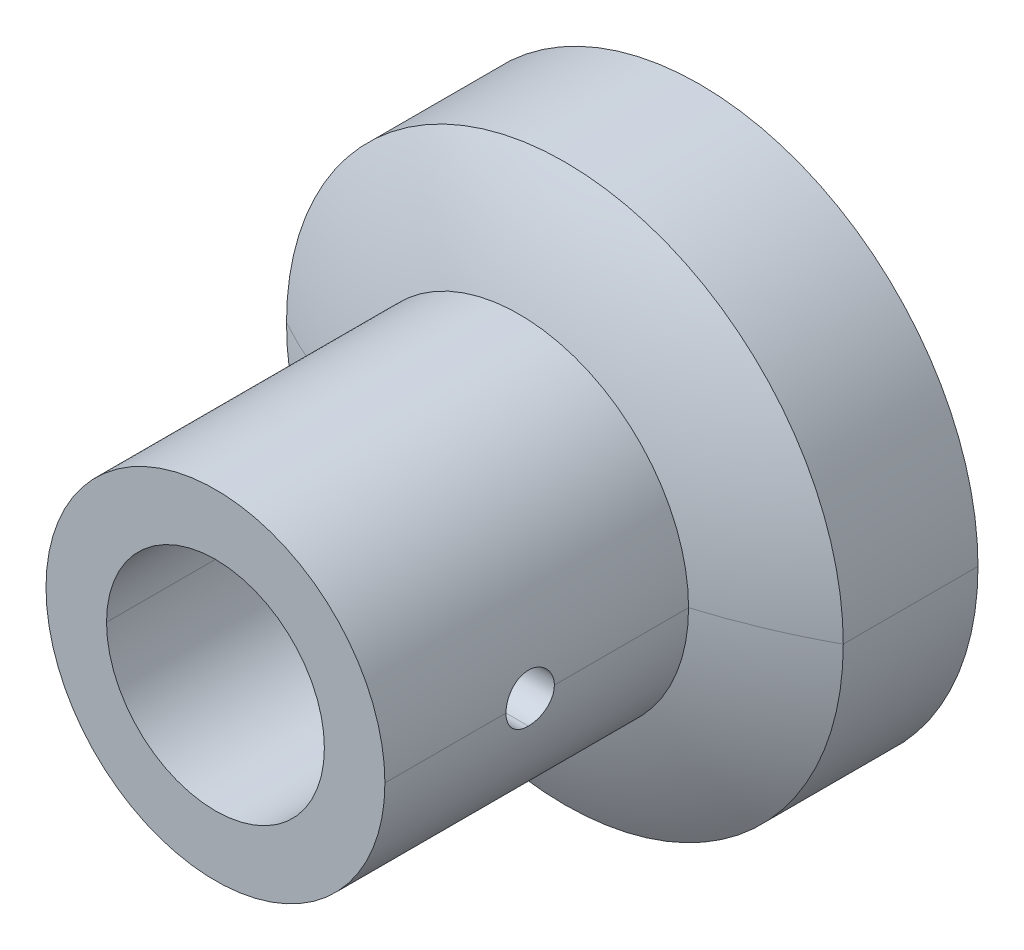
ISO-10303-21;
HEADER;
FILE_DESCRIPTION(('STEP AP214'),'2;1');
FILE_NAME('part.step','',(''),(''),'','','');
FILE_SCHEMA(('AUTOMOTIVE_DESIGN { 1 0 10303 214 1 1 1 1 }'));
ENDSEC;
DATA;
#1=APPLICATION_CONTEXT('core data for automotive mechanical design processes');
#2=APPLICATION_PROTOCOL_DEFINITION('international standard','automotive_design',2000,#1);
#3=PRODUCT_CONTEXT('',#1,'mechanical');
#4=PRODUCT('Part','Part','',(#3));
#5=PRODUCT_RELATED_PRODUCT_CATEGORY('part','',(#4));
#6=PRODUCT_DEFINITION_FORMATION('','',#4);
#7=PRODUCT_DEFINITION_CONTEXT('part definition',#1,'design');
#8=PRODUCT_DEFINITION('design','',#6,#7);
#9=PRODUCT_DEFINITION_SHAPE('','',#8);
#10=(LENGTH_UNIT() NAMED_UNIT(*) SI_UNIT(.MILLI.,.METRE.));
#11=(NAMED_UNIT(*) PLANE_ANGLE_UNIT() SI_UNIT($,.RADIAN.));
#12=(NAMED_UNIT(*) SI_UNIT($,.STERADIAN.) SOLID_ANGLE_UNIT());
#13=UNCERTAINTY_MEASURE_WITH_UNIT(LENGTH_MEASURE(1.E-05),#10,'distance_accuracy_value','');
#14=(GEOMETRIC_REPRESENTATION_CONTEXT(3) GLOBAL_UNCERTAINTY_ASSIGNED_CONTEXT((#13)) GLOBAL_UNIT_ASSIGNED_CONTEXT((#10,
#11,#12)) REPRESENTATION_CONTEXT('',''));
#15=CARTESIAN_POINT('',(0.,0.,0.));
#16=DIRECTION('',(0.,0.,1.));
#17=DIRECTION('',(1.,0.,0.));
#18=AXIS2_PLACEMENT_3D('',#15,#16,#17);
#19=CARTESIAN_POINT('',(-1.22724941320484E-11,0.,11.8371628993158));
#20=DIRECTION('',(0.,0.,1.));
#21=DIRECTION('',(1.,0.,0.));
#22=AXIS2_PLACEMENT_3D('',#19,#20,#21);
#23=CYLINDRICAL_SURFACE('',#22,22.225);
#24=CARTESIAN_POINT('',(22.2249999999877,0.,15.875));
#25=CARTESIAN_POINT('',(22.2250051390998,0.0888218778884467,15.8750090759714));
#26=CARTESIAN_POINT('',(22.2244676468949,0.177639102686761,15.8712728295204));
#27=CARTESIAN_POINT('',(22.2223454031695,0.35462934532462,15.8563799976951));
#28=CARTESIAN_POINT('',(22.2207607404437,0.442802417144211,15.8452240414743));
#29=CARTESIAN_POINT('',(22.2165845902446,0.617782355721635,15.8155794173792));
#30=CARTESIAN_POINT('',(22.2139942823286,0.704590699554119,15.7970993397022));
#31=CARTESIAN_POINT('',(22.2078839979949,0.876304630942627,15.7529632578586));
#32=CARTESIAN_POINT('',(22.2043640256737,0.961210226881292,15.7273072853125));
#33=CARTESIAN_POINT('',(22.1925452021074,1.21222884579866,15.6398058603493));
#34=CARTESIAN_POINT('',(22.1829848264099,1.3747463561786,15.5674093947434));
#35=CARTESIAN_POINT('',(22.1615641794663,1.6852329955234,15.3966742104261));
#36=CARTESIAN_POINT('',(22.1497039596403,1.83320244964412,15.2983360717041));
#37=CARTESIAN_POINT('',(22.1249103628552,2.11154436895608,15.0777541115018));
#38=CARTESIAN_POINT('',(22.1119707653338,2.24180156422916,14.9553652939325));
#39=CARTESIAN_POINT('',(22.0865240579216,2.48001539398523,14.6904496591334));
#40=CARTESIAN_POINT('',(22.0740170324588,2.58796769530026,14.5479189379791));
#41=CARTESIAN_POINT('',(22.0507893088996,2.77896493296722,14.2459777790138));
#42=CARTESIAN_POINT('',(22.0400772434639,2.86189095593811,14.0864914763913));
#43=CARTESIAN_POINT('',(22.0217469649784,2.99969137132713,13.7557109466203));
#44=CARTESIAN_POINT('',(22.0141267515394,3.05458390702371,13.5844244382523));
#45=CARTESIAN_POINT('',(22.0047409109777,3.12133469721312,13.2934388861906));
#46=CARTESIAN_POINT('',(22.0018701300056,3.14144116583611,13.1756014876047));
#47=CARTESIAN_POINT('',(21.9980160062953,3.16827517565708,12.9385271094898));
#48=CARTESIAN_POINT('',(21.9970303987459,3.17501877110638,12.81929198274));
#49=CARTESIAN_POINT('',(21.9970452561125,3.175,12.7));
#50=B_SPLINE_CURVE_WITH_KNOTS('',3,(#24,#25,#26,#27,#28,#29,#30,#31,#32,#33,#34,#35,#36,#37,#38,
#39,#40,#41,#42,#43,#44,#45,#46,#47,#48,#49),.UNSPECIFIED.,.F.,.F.,(4,2,2,2,2,2,2,2,2,2,2,2,4),
(0.,0.266377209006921,0.532731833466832,0.798774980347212,1.0648169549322,1.59659232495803,
2.12835580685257,2.66342937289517,3.1986067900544,3.73628847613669,4.27362173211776,
4.63162414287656,4.98919618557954),.UNSPECIFIED.);
#51=CARTESIAN_POINT('',(22.2249999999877,0.,15.875));
#52=VERTEX_POINT('',#51);
#53=CARTESIAN_POINT('',(21.9970452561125,3.175,12.7));
#54=VERTEX_POINT('',#53);
#55=EDGE_CURVE('E197',#52,#54,#50,.T.);
#56=ORIENTED_EDGE('',*,*,#55,.T.);
#57=CARTESIAN_POINT('',(21.9970452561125,3.175,12.7));
#58=CARTESIAN_POINT('',(21.9970399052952,3.17500908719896,12.6111828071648));
#59=CARTESIAN_POINT('',(21.9975830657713,3.17127322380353,12.5223702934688));
#60=CARTESIAN_POINT('',(21.9997268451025,3.156381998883,12.345389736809));
#61=CARTESIAN_POINT('',(22.0013273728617,3.14522727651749,12.257221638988));
#62=CARTESIAN_POINT('',(22.0055438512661,3.11558617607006,12.0822525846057));
#63=CARTESIAN_POINT('',(22.0081586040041,3.09710844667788,11.9954501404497));
#64=CARTESIAN_POINT('',(22.0143235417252,3.052978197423,11.823748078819));
#65=CARTESIAN_POINT('',(22.0178737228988,3.02732570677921,11.7388484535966));
#66=CARTESIAN_POINT('',(22.0297867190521,2.93983692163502,11.4878486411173));
#67=CARTESIAN_POINT('',(22.0394146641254,2.86745161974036,11.3253437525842));
#68=CARTESIAN_POINT('',(22.0609509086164,2.69674251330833,11.0148778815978));
#69=CARTESIAN_POINT('',(22.0728591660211,2.59841918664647,10.8669166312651));
#70=CARTESIAN_POINT('',(22.097710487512,2.37785216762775,10.5885650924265));
#71=CARTESIAN_POINT('',(22.1106596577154,2.25546015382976,10.4582926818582));
#72=CARTESIAN_POINT('',(22.1360809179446,1.99053188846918,10.2200496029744));
#73=CARTESIAN_POINT('',(22.148552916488,1.84799179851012,10.1120831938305));
#74=CARTESIAN_POINT('',(22.1716798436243,1.54604243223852,9.92107114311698));
#75=CARTESIAN_POINT('',(22.1823261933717,1.38655892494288,9.83814183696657));
#76=CARTESIAN_POINT('',(22.2005247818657,1.05578411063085,9.70033442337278));
#77=CARTESIAN_POINT('',(22.2080790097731,0.884500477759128,9.64543827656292));
#78=CARTESIAN_POINT('',(22.217379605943,0.593504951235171,9.57867729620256));
#79=CARTESIAN_POINT('',(22.2202228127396,0.475653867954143,9.55856622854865));
#80=CARTESIAN_POINT('',(22.2240390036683,0.238552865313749,9.53172627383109));
#81=CARTESIAN_POINT('',(22.2250142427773,0.119304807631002,9.52498125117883));
#82=CARTESIAN_POINT('',(22.2249999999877,0.,9.525));
#83=B_SPLINE_CURVE_WITH_KNOTS('',3,(#57,#58,#59,#60,#61,#62,#63,#64,#65,#66,#67,#68,#69,#70,#71,
#72,#73,#74,#75,#76,#77,#78,#79,#80,#81,#82),.UNSPECIFIED.,.F.,.F.,(4,2,2,2,2,2,2,2,2,2,2,2,4),
(0.,0.266363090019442,0.532703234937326,0.798729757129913,1.06475519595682,1.59649416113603,
2.12822333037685,2.66333816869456,3.19855508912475,3.73622193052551,4.27354234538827,
4.63158555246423,4.98919626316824),.UNSPECIFIED.);
#84=CARTESIAN_POINT('',(22.2249999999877,0.,9.525));
#85=VERTEX_POINT('',#84);
#86=EDGE_CURVE('E170',#54,#85,#83,.T.);
#87=ORIENTED_EDGE('',*,*,#86,.T.);
#88=DIRECTION('',(0.,0.,1.));
#89=VECTOR('',#88,1.);
#90=CARTESIAN_POINT('',(22.2249999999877,0.,11.8371628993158));
#91=LINE('',#90,#89);
#92=CARTESIAN_POINT('',(22.2249999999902,0.,-8.07567420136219));
#93=VERTEX_POINT('',#92);
#94=EDGE_CURVE('E273',#93,#85,#91,.T.);
#95=ORIENTED_EDGE('',*,*,#94,.F.);
#96=CARTESIAN_POINT('',(-1.22724941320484E-11,0.,-8.07567420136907));
#97=DIRECTION('',(0.,0.,1.));
#98=DIRECTION('',(1.,0.,0.));
#99=AXIS2_PLACEMENT_3D('',#96,#97,#98);
#100=CIRCLE('',#99,22.225);
#101=CARTESIAN_POINT('',(-22.2250000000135,0.,-8.07567420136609));
#102=VERTEX_POINT('',#101);
#103=EDGE_CURVE('E101',#102,#93,#100,.F.);
#104=ORIENTED_EDGE('',*,*,#103,.F.);
#105=DIRECTION('',(0.,0.,1.));
#106=VECTOR('',#105,1.);
#107=CARTESIAN_POINT('',(-22.2250000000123,0.,11.8371628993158));
#108=LINE('',#107,#106);
#109=CARTESIAN_POINT('',(-22.2250000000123,0.,31.75));
#110=VERTEX_POINT('',#109);
#111=EDGE_CURVE('E268',#110,#102,#108,.F.);
#112=ORIENTED_EDGE('',*,*,#111,.F.);
#113=CARTESIAN_POINT('',(-1.22724941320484E-11,0.,31.75));
#114=DIRECTION('',(0.,0.,1.));
#115=DIRECTION('',(1.,0.,0.));
#116=AXIS2_PLACEMENT_3D('',#113,#114,#115);
#117=CIRCLE('',#116,22.225);
#118=CARTESIAN_POINT('',(22.2249999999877,0.,31.75));
#119=VERTEX_POINT('',#118);
#120=EDGE_CURVE('E94',#119,#110,#117,.T.);
#121=ORIENTED_EDGE('',*,*,#120,.F.);
#122=DIRECTION('',(0.,0.,1.));
#123=VECTOR('',#122,1.);
#124=CARTESIAN_POINT('',(22.2249999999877,0.,11.8371628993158));
#125=LINE('',#124,#123);
#126=EDGE_CURVE('E270',#52,#119,#125,.T.);
#127=ORIENTED_EDGE('',*,*,#126,.F.);
#128=EDGE_LOOP('',(#56,#87,#95,#104,#112,#121,#127));
#129=FACE_BOUND('',#128,.T.);
#130=ADVANCED_FACE('F16',(#129),#23,.T.);
#131=CARTESIAN_POINT('',(-1.22724941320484E-11,0.,11.8371628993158));
#132=DIRECTION('',(0.,0.,1.));
#133=DIRECTION('',(1.,0.,0.));
#134=AXIS2_PLACEMENT_3D('',#131,#132,#133);
#135=CYLINDRICAL_SURFACE('',#134,22.225);
#136=ORIENTED_EDGE('',*,*,#111,.T.);
#137=CARTESIAN_POINT('',(-1.22724941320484E-11,0.,-8.07567420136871));
#138=DIRECTION('',(0.,0.,1.));
#139=DIRECTION('',(1.,0.,0.));
#140=AXIS2_PLACEMENT_3D('',#137,#138,#139);
#141=CIRCLE('',#140,22.225);
#142=EDGE_CURVE('E132',#93,#102,#141,.F.);
#143=ORIENTED_EDGE('',*,*,#142,.F.);
#144=ORIENTED_EDGE('',*,*,#94,.T.);
#145=CARTESIAN_POINT('',(22.2249999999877,0.,9.525));
#146=CARTESIAN_POINT('',(22.2250051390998,-0.0888218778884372,9.52499092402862));
#147=CARTESIAN_POINT('',(22.2244676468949,-0.177639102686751,9.52872717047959));
#148=CARTESIAN_POINT('',(22.2223454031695,-0.354629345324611,9.54362000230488));
#149=CARTESIAN_POINT('',(22.2207607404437,-0.442802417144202,9.55477595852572));
#150=CARTESIAN_POINT('',(22.2165845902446,-0.617782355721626,9.58442058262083));
#151=CARTESIAN_POINT('',(22.2139942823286,-0.70459069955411,9.60290066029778));
#152=CARTESIAN_POINT('',(22.2078839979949,-0.876304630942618,9.64703674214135));
#153=CARTESIAN_POINT('',(22.2043640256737,-0.961210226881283,9.67269271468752));
#154=CARTESIAN_POINT('',(22.1925452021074,-1.21222884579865,9.76019413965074));
#155=CARTESIAN_POINT('',(22.1829848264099,-1.37474635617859,9.8325906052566));
#156=CARTESIAN_POINT('',(22.1615641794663,-1.68523299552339,10.0033257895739));
#157=CARTESIAN_POINT('',(22.1497039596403,-1.83320244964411,10.1016639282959));
#158=CARTESIAN_POINT('',(22.1249103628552,-2.11154436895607,10.3222458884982));
#159=CARTESIAN_POINT('',(22.1119707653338,-2.24180156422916,10.4446347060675));
#160=CARTESIAN_POINT('',(22.0865240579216,-2.48001539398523,10.7095503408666));
#161=CARTESIAN_POINT('',(22.0740170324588,-2.58796769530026,10.8520810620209));
#162=CARTESIAN_POINT('',(22.0507893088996,-2.77896493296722,11.1540222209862));
#163=CARTESIAN_POINT('',(22.0400772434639,-2.8618909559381,11.3135085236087));
#164=CARTESIAN_POINT('',(22.0217469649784,-2.99969137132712,11.6442890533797));
#165=CARTESIAN_POINT('',(22.0141267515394,-3.05458390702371,11.8155755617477));
#166=CARTESIAN_POINT('',(22.0047409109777,-3.12133469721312,12.1065611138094));
#167=CARTESIAN_POINT('',(22.0018701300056,-3.14144116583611,12.2243985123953));
#168=CARTESIAN_POINT('',(21.9980160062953,-3.16827517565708,12.4614728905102));
#169=CARTESIAN_POINT('',(21.9970303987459,-3.17501877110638,12.58070801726));
#170=CARTESIAN_POINT('',(21.9970452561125,-3.175,12.7));
#171=B_SPLINE_CURVE_WITH_KNOTS('',3,(#145,#146,#147,#148,#149,#150,#151,#152,#153,#154,#155,
#156,#157,#158,#159,#160,#161,#162,#163,#164,#165,#166,#167,#168,#169,#170),.UNSPECIFIED.,.F.,
.F.,(4,2,2,2,2,2,2,2,2,2,2,2,4),(0.,0.266377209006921,0.532731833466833,0.798774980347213,
1.0648169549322,1.59659232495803,2.12835580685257,2.66342937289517,3.1986067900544,
3.73628847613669,4.27362173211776,4.63162414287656,4.98919618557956),.UNSPECIFIED.);
#172=CARTESIAN_POINT('',(21.9970452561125,-3.175,12.7));
#173=VERTEX_POINT('',#172);
#174=EDGE_CURVE('E165',#85,#173,#171,.T.);
#175=ORIENTED_EDGE('',*,*,#174,.T.);
#176=CARTESIAN_POINT('',(21.9970452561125,-3.175,12.7));
#177=CARTESIAN_POINT('',(21.9970399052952,-3.17500908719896,12.7888171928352));
#178=CARTESIAN_POINT('',(21.9975830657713,-3.17127322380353,12.8776297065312));
#179=CARTESIAN_POINT('',(21.9997268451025,-3.156381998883,13.054610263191));
#180=CARTESIAN_POINT('',(22.0013273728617,-3.14522727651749,13.142778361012));
#181=CARTESIAN_POINT('',(22.0055438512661,-3.11558617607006,13.3177474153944));
#182=CARTESIAN_POINT('',(22.0081586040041,-3.09710844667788,13.4045498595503));
#183=CARTESIAN_POINT('',(22.0143235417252,-3.052978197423,13.576251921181));
#184=CARTESIAN_POINT('',(22.0178737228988,-3.02732570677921,13.6611515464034));
#185=CARTESIAN_POINT('',(22.0297867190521,-2.93983692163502,13.9121513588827));
#186=CARTESIAN_POINT('',(22.0394146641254,-2.86745161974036,14.0746562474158));
#187=CARTESIAN_POINT('',(22.0609509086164,-2.69674251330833,14.3851221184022));
#188=CARTESIAN_POINT('',(22.0728591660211,-2.59841918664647,14.5330833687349));
#189=CARTESIAN_POINT('',(22.097710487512,-2.37785216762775,14.8114349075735));
#190=CARTESIAN_POINT('',(22.1106596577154,-2.25546015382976,14.9417073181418));
#191=CARTESIAN_POINT('',(22.1360809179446,-1.99053188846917,15.1799503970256));
#192=CARTESIAN_POINT('',(22.148552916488,-1.84799179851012,15.2879168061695));
#193=CARTESIAN_POINT('',(22.1716798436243,-1.54604243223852,15.478928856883));
#194=CARTESIAN_POINT('',(22.1823261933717,-1.38655892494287,15.5618581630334));
#195=CARTESIAN_POINT('',(22.2005247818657,-1.05578411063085,15.6996655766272));
#196=CARTESIAN_POINT('',(22.2080790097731,-0.884500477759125,15.7545617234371));
#197=CARTESIAN_POINT('',(22.217379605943,-0.593504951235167,15.8213227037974));
#198=CARTESIAN_POINT('',(22.2202228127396,-0.475653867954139,15.8414337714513));
#199=CARTESIAN_POINT('',(22.2240390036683,-0.238552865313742,15.8682737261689));
#200=CARTESIAN_POINT('',(22.2250142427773,-0.119304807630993,15.8750187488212));
#201=CARTESIAN_POINT('',(22.2249999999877,0.,15.875));
#202=B_SPLINE_CURVE_WITH_KNOTS('',3,(#176,#177,#178,#179,#180,#181,#182,#183,#184,#185,#186,
#187,#188,#189,#190,#191,#192,#193,#194,#195,#196,#197,#198,#199,#200,#201),.UNSPECIFIED.,.F.,
.F.,(4,2,2,2,2,2,2,2,2,2,2,2,4),(0.,0.266363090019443,0.532703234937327,0.798729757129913,
1.06475519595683,1.59649416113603,2.12822333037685,2.66333816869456,3.19855508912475,
3.73622193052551,4.27354234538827,4.63158555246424,4.98919626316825),.UNSPECIFIED.);
#203=EDGE_CURVE('E189',#173,#52,#202,.T.);
#204=ORIENTED_EDGE('',*,*,#203,.T.);
#205=ORIENTED_EDGE('',*,*,#126,.T.);
#206=CARTESIAN_POINT('',(-1.22724941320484E-11,0.,31.75));
#207=DIRECTION('',(0.,0.,1.));
#208=DIRECTION('',(1.,0.,0.));
#209=AXIS2_PLACEMENT_3D('',#206,#207,#208);
#210=CIRCLE('',#209,22.225);
#211=EDGE_CURVE('E355',#110,#119,#210,.T.);
#212=ORIENTED_EDGE('',*,*,#211,.F.);
#213=EDGE_LOOP('',(#136,#143,#144,#175,#204,#205,#212));
#214=FACE_BOUND('',#213,.T.);
#215=ADVANCED_FACE('F179',(#214),#135,.T.);
#216=CARTESIAN_POINT('',(0.,0.,-80.9624999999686));
#217=DIRECTION('',(0.204457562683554,0.963484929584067,0.172898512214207));
#218=DIRECTION('',(-0.859691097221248,0.0922736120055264,0.502410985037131));
#219=AXIS2_PLACEMENT_3D('',#216,#217,#218);
#220=SPHERICAL_SURFACE('',#219,76.1999999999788);
#221=CARTESIAN_POINT('',(-22.2250000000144,0.,-8.07567420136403));
#222=CARTESIAN_POINT('',(-22.7846731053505,-3.55013624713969E-06,-8.24633102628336));
#223=CARTESIAN_POINT('',(-23.3423801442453,-4.0679638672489E-05,-8.42343670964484));
#224=CARTESIAN_POINT('',(-24.4703018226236,-0.000145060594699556,-8.79597338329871));
#225=CARTESIAN_POINT('',(-25.0403872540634,-0.000213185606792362,-8.99179565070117));
#226=CARTESIAN_POINT('',(-26.1923629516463,-0.000339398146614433,-9.40283955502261));
#227=CARTESIAN_POINT('',(-26.7741105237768,-0.000397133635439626,-9.61846117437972));
#228=CARTESIAN_POINT('',(-27.9486382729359,-0.00048011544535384,-10.0701824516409));
#229=CARTESIAN_POINT('',(-28.5412615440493,-0.000504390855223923,-10.306690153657));
#230=CARTESIAN_POINT('',(-29.7366948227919,-0.000510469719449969,-10.8012650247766));
#231=CARTESIAN_POINT('',(-30.3393329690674,-0.000491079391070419,-11.0597476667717));
#232=CARTESIAN_POINT('',(-31.5538736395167,-0.000415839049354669,-11.5993509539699));
#233=CARTESIAN_POINT('',(-32.1655886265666,-0.000359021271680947,-11.8808937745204));
#234=CARTESIAN_POINT('',(-33.397280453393,-0.000230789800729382,-12.4676892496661));
#235=CARTESIAN_POINT('',(-34.017053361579,-0.000159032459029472,-12.7733700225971));
#236=CARTESIAN_POINT('',(-35.2637777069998,-4.44316623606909E-05,-13.4094966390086));
#237=CARTESIAN_POINT('',(-35.8905081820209,-2.37351360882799E-06,-13.7403756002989));
#238=CARTESIAN_POINT('',(-36.5125000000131,0.,-14.0799361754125));
#239=B_SPLINE_CURVE_WITH_KNOTS('',3,(#221,#222,#223,#224,#225,#226,#227,#228,#229,#230,#231,
#232,#233,#234,#235,#236,#237,#238),.UNSPECIFIED.,.F.,.F.,(4,2,2,2,2,2,2,2,4),(0.,
1.75530258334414,3.56347297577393,5.42455263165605,7.33857288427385,9.30555397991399,
11.3255040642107,13.3984181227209,15.5242768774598),.UNSPECIFIED.);
#240=CARTESIAN_POINT('',(-36.5125000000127,0.,-14.0799361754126));
#241=VERTEX_POINT('',#240);
#242=EDGE_CURVE('E113',#102,#241,#239,.T.);
#243=ORIENTED_EDGE('',*,*,#242,.F.);
#244=ORIENTED_EDGE('',*,*,#103,.T.);
#245=CARTESIAN_POINT('',(36.5124999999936,0.,-14.0799361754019));
#246=CARTESIAN_POINT('',(35.9537311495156,-7.32572720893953E-07,-13.7748912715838));
#247=CARTESIAN_POINT('',(35.3911378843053,-8.35959394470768E-06,-13.476851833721));
#248=CARTESIAN_POINT('',(34.2561431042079,-2.94500270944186E-05,-12.8936710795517));
#249=CARTESIAN_POINT('',(33.6837091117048,-4.29392258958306E-05,-12.6085929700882));
#250=CARTESIAN_POINT('',(32.5292518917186,-6.77080975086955E-05,-12.0516854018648));
#251=CARTESIAN_POINT('',(31.9471970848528,-7.897754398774E-05,-11.7799214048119));
#252=CARTESIAN_POINT('',(30.7737311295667,-9.48200927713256E-05,-11.2499916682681));
#253=CARTESIAN_POINT('',(30.1822894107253,-9.93624111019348E-05,-10.9918936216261));
#254=CARTESIAN_POINT('',(28.9902952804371,-9.99589619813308E-05,-10.4896471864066));
#255=CARTESIAN_POINT('',(28.3897134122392,-9.59739075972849E-05,-10.2455687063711));
#256=CARTESIAN_POINT('',(27.1796983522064,-8.089990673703E-05,-9.77171309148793));
#257=CARTESIAN_POINT('',(26.5702369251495,-6.97778772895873E-05,-9.54200805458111));
#258=CARTESIAN_POINT('',(25.3427358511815,-4.4770170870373E-05,-9.09725201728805));
#259=CARTESIAN_POINT('',(24.7246692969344,-3.08717010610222E-05,-8.88227527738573));
#260=CARTESIAN_POINT('',(23.4802464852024,-8.86461372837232E-06,-8.46732534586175));
#261=CARTESIAN_POINT('',(22.8538647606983,-7.83900229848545E-07,-8.26742852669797));
#262=CARTESIAN_POINT('',(22.2249999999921,0.,-8.07567420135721));
#263=B_SPLINE_CURVE_WITH_KNOTS('',3,(#245,#246,#247,#248,#249,#250,#251,#252,#253,#254,#255,
#256,#257,#258,#259,#260,#261,#262),.UNSPECIFIED.,.F.,.F.,(4,2,2,2,2,2,2,2,4),(0.,
1.9097865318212,3.82806034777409,5.75497487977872,7.69068019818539,9.63532280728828,
11.5890454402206,13.5519868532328,15.5242816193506),.UNSPECIFIED.);
#264=CARTESIAN_POINT('',(36.5124999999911,0.,-14.0799361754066));
#265=VERTEX_POINT('',#264);
#266=EDGE_CURVE('E117',#265,#93,#263,.T.);
#267=ORIENTED_EDGE('',*,*,#266,.F.);
#268=CARTESIAN_POINT('',(-1.22724941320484E-11,0.,-14.0799361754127));
#269=DIRECTION('',(0.,0.,1.));
#270=DIRECTION('',(1.,0.,0.));
#271=AXIS2_PLACEMENT_3D('',#268,#269,#270);
#272=CIRCLE('',#271,36.5125);
#273=EDGE_CURVE('E110',#241,#265,#272,.F.);
#274=ORIENTED_EDGE('',*,*,#273,.F.);
#275=EDGE_LOOP('',(#243,#244,#267,#274));
#276=FACE_BOUND('',#275,.T.);
#277=ADVANCED_FACE('F112',(#276),#220,.T.);
#278=CARTESIAN_POINT('',(0.,0.,-80.9624999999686));
#279=DIRECTION('',(0.204457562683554,0.963484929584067,0.172898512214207));
#280=DIRECTION('',(-0.859691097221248,0.0922736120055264,0.502410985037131));
#281=AXIS2_PLACEMENT_3D('',#278,#279,#280);
#282=SPHERICAL_SURFACE('',#281,76.1999999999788);
#283=ORIENTED_EDGE('',*,*,#242,.T.);
#284=CARTESIAN_POINT('',(-1.22724941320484E-11,0.,-14.0799361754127));
#285=DIRECTION('',(0.,0.,1.));
#286=DIRECTION('',(1.,0.,0.));
#287=AXIS2_PLACEMENT_3D('',#284,#285,#286);
#288=CIRCLE('',#287,36.5125);
#289=EDGE_CURVE('E129',#265,#241,#288,.F.);
#290=ORIENTED_EDGE('',*,*,#289,.F.);
#291=ORIENTED_EDGE('',*,*,#266,.T.);
#292=ORIENTED_EDGE('',*,*,#142,.T.);
#293=EDGE_LOOP('',(#283,#290,#291,#292));
#294=FACE_BOUND('',#293,.T.);
#295=ADVANCED_FACE('F127',(#294),#282,.T.);
#296=CARTESIAN_POINT('',(13.969999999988,0.,12.7));
#297=DIRECTION('',(-1.,0.,0.));
#298=DIRECTION('',(0.,0.,1.));
#299=AXIS2_PLACEMENT_3D('',#296,#297,#298);
#300=PLANE('',#299);
#301=CARTESIAN_POINT('',(13.969999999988,0.,12.7));
#302=DIRECTION('',(1.,0.,0.));
#303=DIRECTION('',(0.,0.,-1.));
#304=AXIS2_PLACEMENT_3D('',#301,#302,#303);
#305=CIRCLE('',#304,3.175);
#306=CARTESIAN_POINT('',(13.969999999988,2.99528900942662,11.6469716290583));
#307=VERTEX_POINT('',#306);
#308=CARTESIAN_POINT('',(13.969999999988,3.175,12.7));
#309=VERTEX_POINT('',#308);
#310=EDGE_CURVE('E160',#307,#309,#305,.T.);
#311=ORIENTED_EDGE('',*,*,#310,.T.);
#312=CARTESIAN_POINT('',(13.969999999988,0.,12.7));
#313=DIRECTION('',(1.,0.,0.));
#314=DIRECTION('',(0.,0.,-1.));
#315=AXIS2_PLACEMENT_3D('',#312,#313,#314);
#316=CIRCLE('',#315,3.175);
#317=CARTESIAN_POINT('',(13.969999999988,2.99528900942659,13.7530283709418));
#318=VERTEX_POINT('',#317);
#319=EDGE_CURVE('E198',#309,#318,#316,.T.);
#320=ORIENTED_EDGE('',*,*,#319,.T.);
#321=DIRECTION('',(0.,0.,1.));
#322=VECTOR('',#321,1.);
#323=CARTESIAN_POINT('',(13.969999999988,2.99528900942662,0.));
#324=LINE('',#323,#322);
#325=EDGE_CURVE('E315',#307,#318,#324,.T.);
#326=ORIENTED_EDGE('',*,*,#325,.F.);
#327=EDGE_LOOP('',(#311,#320,#326));
#328=FACE_BOUND('',#327,.T.);
#329=ADVANCED_FACE('F302',(#328),#300,.F.);
#330=CARTESIAN_POINT('',(18.256249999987,0.,31.75));
#331=DIRECTION('',(0.,0.,1.));
#332=DIRECTION('',(1.,0.,0.));
#333=AXIS2_PLACEMENT_3D('',#330,#331,#332);
#334=PLANE('',#333);
#335=ORIENTED_EDGE('',*,*,#120,.T.);
#336=ORIENTED_EDGE('',*,*,#211,.T.);
#337=EDGE_LOOP('',(#335,#336));
#338=FACE_BOUND('',#337,.T.);
#339=CARTESIAN_POINT('',(-1.22731685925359E-11,0.,31.75));
#340=DIRECTION('',(0.,0.,1.));
#341=DIRECTION('',(1.,0.,0.));
#342=AXIS2_PLACEMENT_3D('',#339,#340,#341);
#343=CIRCLE('',#342,14.2875);
#344=CARTESIAN_POINT('',(14.2874999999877,0.,31.75));
#345=VERTEX_POINT('',#344);
#346=CARTESIAN_POINT('',(-14.2875000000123,0.,31.75));
#347=VERTEX_POINT('',#346);
#348=EDGE_CURVE('E332',#345,#347,#343,.T.);
#349=ORIENTED_EDGE('',*,*,#348,.F.);
#350=CARTESIAN_POINT('',(-1.22731685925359E-11,0.,31.75));
#351=DIRECTION('',(0.,0.,1.));
#352=DIRECTION('',(1.,0.,0.));
#353=AXIS2_PLACEMENT_3D('',#350,#351,#352);
#354=CIRCLE('',#353,14.2875);
#355=EDGE_CURVE('E235',#347,#345,#354,.T.);
#356=ORIENTED_EDGE('',*,*,#355,.F.);
#357=EDGE_LOOP('',(#349,#356));
#358=FACE_BOUND('',#357,.T.);
#359=ADVANCED_FACE('F208',(#338,#358),#334,.T.);
#360=CARTESIAN_POINT('',(18.732499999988,0.,12.7));
#361=DIRECTION('',(1.,0.,0.));
#362=DIRECTION('',(0.,0.,-1.));
#363=AXIS2_PLACEMENT_3D('',#360,#361,#362);
#364=CYLINDRICAL_SURFACE('',#363,3.175);
#365=ORIENTED_EDGE('',*,*,#55,.F.);
#366=ORIENTED_EDGE('',*,*,#203,.F.);
#367=DIRECTION('',(1.,0.,0.));
#368=VECTOR('',#367,1.);
#369=CARTESIAN_POINT('',(18.732499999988,-3.175,12.7));
#370=LINE('',#369,#368);
#371=CARTESIAN_POINT('',(13.969999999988,-3.175,12.7));
#372=VERTEX_POINT('',#371);
#373=EDGE_CURVE('E164',#173,#372,#370,.F.);
#374=ORIENTED_EDGE('',*,*,#373,.T.);
#375=CARTESIAN_POINT('',(13.969999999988,0.,12.7));
#376=DIRECTION('',(1.,0.,0.));
#377=DIRECTION('',(0.,0.,-1.));
#378=AXIS2_PLACEMENT_3D('',#375,#376,#377);
#379=CIRCLE('',#378,3.175);
#380=CARTESIAN_POINT('',(13.969999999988,-2.99528900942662,13.7530283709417));
#381=VERTEX_POINT('',#380);
#382=EDGE_CURVE('E344',#372,#381,#379,.F.);
#383=ORIENTED_EDGE('',*,*,#382,.T.);
#384=CARTESIAN_POINT('',(14.2874999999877,0.,15.875));
#385=CARTESIAN_POINT('',(14.2875077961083,-0.0881471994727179,15.8750097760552));
#386=CARTESIAN_POINT('',(14.2866844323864,-0.176288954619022,15.8713292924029));
#387=CARTESIAN_POINT('',(14.283433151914,-0.351921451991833,15.8566635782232));
#388=CARTESIAN_POINT('',(14.281005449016,-0.439412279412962,15.8456793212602));
#389=CARTESIAN_POINT('',(14.2746084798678,-0.612984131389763,15.8165057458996));
#390=CARTESIAN_POINT('',(14.2706417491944,-0.699067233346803,15.7983282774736));
#391=CARTESIAN_POINT('',(14.2612830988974,-0.869336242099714,15.7549318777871));
#392=CARTESIAN_POINT('',(14.2558911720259,-0.953522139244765,15.7297129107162));
#393=CARTESIAN_POINT('',(14.2377856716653,-1.20235132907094,15.6437560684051));
#394=CARTESIAN_POINT('',(14.2231362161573,-1.36342276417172,15.572691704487));
#395=CARTESIAN_POINT('',(14.1902590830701,-1.67130831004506,15.4052028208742));
#396=CARTESIAN_POINT('',(14.1720305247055,-1.81811889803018,15.3087720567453));
#397=CARTESIAN_POINT('',(14.1336522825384,-2.09582417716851,15.0915835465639));
#398=CARTESIAN_POINT('',(14.1134779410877,-2.22644795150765,14.9704834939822));
#399=CARTESIAN_POINT('',(14.0736609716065,-2.46565444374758,14.7081465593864));
#400=CARTESIAN_POINT('',(14.05401810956,-2.57424700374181,14.56691871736));
#401=CARTESIAN_POINT('',(14.023032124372,-2.73713072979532,14.313695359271));
#402=CARTESIAN_POINT('',(14.010982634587,-2.79788919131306,14.2058872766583));
#403=CARTESIAN_POINT('',(13.9888584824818,-2.90645324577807,13.9839115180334));
#404=CARTESIAN_POINT('',(13.9787814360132,-2.95427450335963,13.8697517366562));
#405=CARTESIAN_POINT('',(13.969999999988,-2.99528900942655,13.7530283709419));
#406=B_SPLINE_CURVE_WITH_KNOTS('',3,(#384,#385,#386,#387,#388,#389,#390,#391,#392,#393,#394,
#395,#396,#397,#398,#399,#400,#401,#402,#403,#404,#405),.UNSPECIFIED.,.F.,.F.,(4,2,2,2,2,2,2,2,
2,2,4),(0.,0.264351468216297,0.528667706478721,0.792550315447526,1.05643426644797,
1.5837311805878,2.11115802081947,2.64647409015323,3.18155048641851,3.55375272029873,
3.92550224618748),.UNSPECIFIED.);
#407=CARTESIAN_POINT('',(14.2874999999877,0.,15.875));
#408=VERTEX_POINT('',#407);
#409=EDGE_CURVE('E220',#408,#381,#406,.T.);
#410=ORIENTED_EDGE('',*,*,#409,.F.);
#411=CARTESIAN_POINT('',(13.969999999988,2.99528900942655,13.7530283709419));
#412=CARTESIAN_POINT('',(13.9763685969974,2.96556824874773,13.837592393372));
#413=CARTESIAN_POINT('',(13.9834125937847,2.932270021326,13.9208385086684));
#414=CARTESIAN_POINT('',(13.9986167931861,2.85881419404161,14.0841266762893));
#415=CARTESIAN_POINT('',(14.0067768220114,2.81865766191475,14.1641692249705));
#416=CARTESIAN_POINT('',(14.0239735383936,2.73180711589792,14.3204443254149));
#417=CARTESIAN_POINT('',(14.0330094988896,2.68511850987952,14.3966799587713));
#418=CARTESIAN_POINT('',(14.0516975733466,2.58554118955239,14.5448799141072));
#419=CARTESIAN_POINT('',(14.0613496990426,2.53265235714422,14.6168441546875));
#420=CARTESIAN_POINT('',(14.0908200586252,2.3652189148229,14.8255854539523));
#421=CARTESIAN_POINT('',(14.1111696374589,2.24182355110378,14.9553614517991));
#422=CARTESIAN_POINT('',(14.1509800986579,1.974990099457,15.1923730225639));
#423=CARTESIAN_POINT('',(14.17044095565,1.83155143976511,15.2996079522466));
#424=CARTESIAN_POINT('',(14.2064445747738,1.52746525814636,15.4892238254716));
#425=CARTESIAN_POINT('',(14.2229683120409,1.36671565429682,15.5714450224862));
#426=CARTESIAN_POINT('',(14.2510670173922,1.03327127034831,15.7075483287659));
#427=CARTESIAN_POINT('',(14.2626453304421,0.860584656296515,15.7614495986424));
#428=CARTESIAN_POINT('',(14.2764796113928,0.572245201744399,15.8251266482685));
#429=CARTESIAN_POINT('',(14.2805929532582,0.458572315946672,15.8438121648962));
#430=CARTESIAN_POINT('',(14.2861107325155,0.229951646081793,15.8687494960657));
#431=CARTESIAN_POINT('',(14.2875185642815,0.115005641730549,15.8750168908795));
#432=CARTESIAN_POINT('',(14.2874999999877,0.,15.875));
#433=B_SPLINE_CURVE_WITH_KNOTS('',3,(#411,#412,#413,#414,#415,#416,#417,#418,#419,#420,#421,
#422,#423,#424,#425,#426,#427,#428,#429,#430,#431,#432),.UNSPECIFIED.,.F.,.F.,(4,2,2,2,2,2,2,2,
2,2,4),(0.,0.269485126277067,0.538928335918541,0.808149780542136,1.07737635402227,
1.61531694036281,2.15327287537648,2.69459555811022,3.23555152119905,3.58070819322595,
3.92543154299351),.UNSPECIFIED.);
#434=EDGE_CURVE('E213',#318,#408,#433,.T.);
#435=ORIENTED_EDGE('',*,*,#434,.F.);
#436=ORIENTED_EDGE('',*,*,#319,.F.);
#437=DIRECTION('',(1.,0.,0.));
#438=VECTOR('',#437,1.);
#439=CARTESIAN_POINT('',(18.732499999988,3.175,12.7));
#440=LINE('',#439,#438);
#441=EDGE_CURVE('E123',#309,#54,#440,.T.);
#442=ORIENTED_EDGE('',*,*,#441,.T.);
#443=EDGE_LOOP('',(#365,#366,#374,#383,#410,#435,#436,#442));
#444=FACE_BOUND('',#443,.T.);
#445=ADVANCED_FACE('F203',(#444),#364,.F.);
#446=CARTESIAN_POINT('',(13.969999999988,0.,12.7));
#447=DIRECTION('',(-1.,0.,0.));
#448=DIRECTION('',(0.,0.,1.));
#449=AXIS2_PLACEMENT_3D('',#446,#447,#448);
#450=PLANE('',#449);
#451=ORIENTED_EDGE('',*,*,#382,.F.);
#452=CARTESIAN_POINT('',(13.969999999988,0.,12.7));
#453=DIRECTION('',(1.,0.,0.));
#454=DIRECTION('',(0.,0.,-1.));
#455=AXIS2_PLACEMENT_3D('',#452,#453,#454);
#456=CIRCLE('',#455,3.175);
#457=CARTESIAN_POINT('',(13.969999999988,-2.99528900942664,11.6469716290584));
#458=VERTEX_POINT('',#457);
#459=EDGE_CURVE('E162',#372,#458,#456,.T.);
#460=ORIENTED_EDGE('',*,*,#459,.T.);
#461=DIRECTION('',(0.,0.,1.));
#462=VECTOR('',#461,1.);
#463=CARTESIAN_POINT('',(13.969999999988,-2.99528900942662,0.));
#464=LINE('',#463,#462);
#465=EDGE_CURVE('E228',#381,#458,#464,.F.);
#466=ORIENTED_EDGE('',*,*,#465,.F.);
#467=EDGE_LOOP('',(#451,#460,#466));
#468=FACE_BOUND('',#467,.T.);
#469=ADVANCED_FACE('F207',(#468),#450,.F.);
#470=CARTESIAN_POINT('',(18.732499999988,0.,12.7));
#471=DIRECTION('',(1.,0.,0.));
#472=DIRECTION('',(0.,0.,-1.));
#473=AXIS2_PLACEMENT_3D('',#470,#471,#472);
#474=CYLINDRICAL_SURFACE('',#473,3.175);
#475=ORIENTED_EDGE('',*,*,#310,.F.);
#476=CARTESIAN_POINT('',(14.2874999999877,0.,9.525));
#477=CARTESIAN_POINT('',(14.2875077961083,0.0881471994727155,9.52499022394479));
#478=CARTESIAN_POINT('',(14.2866844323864,0.17628895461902,9.52867070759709));
#479=CARTESIAN_POINT('',(14.283433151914,0.351921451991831,9.5433364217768));
#480=CARTESIAN_POINT('',(14.281005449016,0.43941227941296,9.55432067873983));
#481=CARTESIAN_POINT('',(14.2746084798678,0.612984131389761,9.58349425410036));
#482=CARTESIAN_POINT('',(14.2706417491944,0.699067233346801,9.60167172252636));
#483=CARTESIAN_POINT('',(14.2612830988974,0.869336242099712,9.64506812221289));
#484=CARTESIAN_POINT('',(14.2558911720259,0.953522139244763,9.67028708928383));
#485=CARTESIAN_POINT('',(14.2377856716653,1.20235132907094,9.75624393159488));
#486=CARTESIAN_POINT('',(14.2231362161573,1.36342276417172,9.82730829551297));
#487=CARTESIAN_POINT('',(14.1902590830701,1.67130831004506,9.99479717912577));
#488=CARTESIAN_POINT('',(14.1720305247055,1.81811889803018,10.0912279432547));
#489=CARTESIAN_POINT('',(14.1336522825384,2.0958241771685,10.3084164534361));
#490=CARTESIAN_POINT('',(14.1134779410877,2.22644795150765,10.4295165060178));
#491=CARTESIAN_POINT('',(14.0736609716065,2.46565444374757,10.6918534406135));
#492=CARTESIAN_POINT('',(14.05401810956,2.57424700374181,10.83308128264));
#493=CARTESIAN_POINT('',(14.023032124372,2.73713072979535,11.0863046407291));
#494=CARTESIAN_POINT('',(14.0109826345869,2.79788919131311,11.1941127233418));
#495=CARTESIAN_POINT('',(13.9888584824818,2.90645324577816,11.4160884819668));
#496=CARTESIAN_POINT('',(13.9787814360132,2.95427450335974,11.5302482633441));
#497=CARTESIAN_POINT('',(13.969999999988,2.99528900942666,11.6469716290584));
#498=B_SPLINE_CURVE_WITH_KNOTS('',3,(#476,#477,#478,#479,#480,#481,#482,#483,#484,#485,#486,
#487,#488,#489,#490,#491,#492,#493,#494,#495,#496,#497),.UNSPECIFIED.,.F.,.F.,(4,2,2,2,2,2,2,2,
2,2,4),(0.,0.264351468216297,0.528667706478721,0.792550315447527,1.05643426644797,
1.5837311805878,2.11115802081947,2.64647409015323,3.18155048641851,3.5537527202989,
3.92550224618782),.UNSPECIFIED.);
#499=CARTESIAN_POINT('',(14.2874999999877,0.,9.525));
#500=VERTEX_POINT('',#499);
#501=EDGE_CURVE('E143',#500,#307,#498,.T.);
#502=ORIENTED_EDGE('',*,*,#501,.F.);
#503=CARTESIAN_POINT('',(13.969999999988,-2.99528900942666,11.6469716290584));
#504=CARTESIAN_POINT('',(13.9763685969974,-2.96556824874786,11.5624076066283));
#505=CARTESIAN_POINT('',(13.9834125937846,-2.93227002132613,11.4791614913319));
#506=CARTESIAN_POINT('',(13.9986167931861,-2.85881419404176,11.3158733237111));
#507=CARTESIAN_POINT('',(14.0067768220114,-2.81865766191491,11.2358307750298));
#508=CARTESIAN_POINT('',(14.0239735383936,-2.73180711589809,11.0795556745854));
#509=CARTESIAN_POINT('',(14.0330094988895,-2.6851185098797,11.003320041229));
#510=CARTESIAN_POINT('',(14.0516975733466,-2.58554118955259,10.8551200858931));
#511=CARTESIAN_POINT('',(14.0613496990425,-2.53265235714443,10.7831558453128));
#512=CARTESIAN_POINT('',(14.0908200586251,-2.36521891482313,10.5744145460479));
#513=CARTESIAN_POINT('',(14.1111696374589,-2.24182355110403,10.4446385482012));
#514=CARTESIAN_POINT('',(14.1509800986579,-1.97499009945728,10.2076269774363));
#515=CARTESIAN_POINT('',(14.17044095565,-1.8315514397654,10.1003920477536));
#516=CARTESIAN_POINT('',(14.2064445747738,-1.52746525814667,9.91077617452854));
#517=CARTESIAN_POINT('',(14.2229683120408,-1.36671565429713,9.8285549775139));
#518=CARTESIAN_POINT('',(14.2510670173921,-1.03327127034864,9.69245167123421));
#519=CARTESIAN_POINT('',(14.2626453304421,-0.86058465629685,9.63855040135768));
#520=CARTESIAN_POINT('',(14.2764796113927,-0.572245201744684,9.57487335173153));
#521=CARTESIAN_POINT('',(14.2805929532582,-0.458572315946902,9.55618783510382));
#522=CARTESIAN_POINT('',(14.2861107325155,-0.22995164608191,9.53125050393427));
#523=CARTESIAN_POINT('',(14.2875185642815,-0.115005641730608,9.52498310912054));
#524=CARTESIAN_POINT('',(14.2874999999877,0.,9.525));
#525=B_SPLINE_CURVE_WITH_KNOTS('',3,(#503,#504,#505,#506,#507,#508,#509,#510,#511,#512,#513,
#514,#515,#516,#517,#518,#519,#520,#521,#522,#523,#524),.UNSPECIFIED.,.F.,.F.,(4,2,2,2,2,2,2,2,
2,2,4),(0.,0.269485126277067,0.538928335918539,0.808149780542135,1.07737635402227,
1.6153169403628,2.15327287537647,2.69459555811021,3.23555152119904,3.58070819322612,
3.92543154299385),.UNSPECIFIED.);
#526=EDGE_CURVE('E230',#458,#500,#525,.T.);
#527=ORIENTED_EDGE('',*,*,#526,.F.);
#528=ORIENTED_EDGE('',*,*,#459,.F.);
#529=ORIENTED_EDGE('',*,*,#373,.F.);
#530=ORIENTED_EDGE('',*,*,#174,.F.);
#531=ORIENTED_EDGE('',*,*,#86,.F.);
#532=ORIENTED_EDGE('',*,*,#441,.F.);
#533=EDGE_LOOP('',(#475,#502,#527,#528,#529,#530,#531,#532));
#534=FACE_BOUND('',#533,.T.);
#535=ADVANCED_FACE('F175',(#534),#474,.F.);
#536=CARTESIAN_POINT('',(-1.22724941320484E-11,0.,-22.9149680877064));
#537=DIRECTION('',(0.,0.,1.));
#538=DIRECTION('',(1.,0.,0.));
#539=AXIS2_PLACEMENT_3D('',#536,#537,#538);
#540=CYLINDRICAL_SURFACE('',#539,36.5125);
#541=DIRECTION('',(0.,0.,1.));
#542=VECTOR('',#541,1.);
#543=CARTESIAN_POINT('',(-36.5125000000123,0.,-22.9149680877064));
#544=LINE('',#543,#542);
#545=CARTESIAN_POINT('',(-36.5125000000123,0.,-31.75));
#546=VERTEX_POINT('',#545);
#547=EDGE_CURVE('E136',#241,#546,#544,.F.);
#548=ORIENTED_EDGE('',*,*,#547,.F.);
#549=ORIENTED_EDGE('',*,*,#273,.T.);
#550=DIRECTION('',(0.,0.,1.));
#551=VECTOR('',#550,1.);
#552=CARTESIAN_POINT('',(36.5124999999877,0.,-22.9149680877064));
#553=LINE('',#552,#551);
#554=CARTESIAN_POINT('',(36.5124999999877,0.,-31.75));
#555=VERTEX_POINT('',#554);
#556=EDGE_CURVE('E122',#555,#265,#553,.T.);
#557=ORIENTED_EDGE('',*,*,#556,.F.);
#558=CARTESIAN_POINT('',(-1.22724941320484E-11,0.,-31.75));
#559=DIRECTION('',(0.,0.,1.));
#560=DIRECTION('',(1.,0.,0.));
#561=AXIS2_PLACEMENT_3D('',#558,#559,#560);
#562=CIRCLE('',#561,36.5125);
#563=EDGE_CURVE('E139',#546,#555,#562,.F.);
#564=ORIENTED_EDGE('',*,*,#563,.F.);
#565=EDGE_LOOP('',(#548,#549,#557,#564));
#566=FACE_BOUND('',#565,.T.);
#567=ADVANCED_FACE('F137',(#566),#540,.T.);
#568=CARTESIAN_POINT('',(-1.22724941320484E-11,0.,-22.9149680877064));
#569=DIRECTION('',(0.,0.,1.));
#570=DIRECTION('',(1.,0.,0.));
#571=AXIS2_PLACEMENT_3D('',#568,#569,#570);
#572=CYLINDRICAL_SURFACE('',#571,36.5125);
#573=ORIENTED_EDGE('',*,*,#547,.T.);
#574=CARTESIAN_POINT('',(-1.22724941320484E-11,0.,-31.75));
#575=DIRECTION('',(0.,0.,1.));
#576=DIRECTION('',(1.,0.,0.));
#577=AXIS2_PLACEMENT_3D('',#574,#575,#576);
#578=CIRCLE('',#577,36.5125);
#579=EDGE_CURVE('E261',#555,#546,#578,.F.);
#580=ORIENTED_EDGE('',*,*,#579,.F.);
#581=ORIENTED_EDGE('',*,*,#556,.T.);
#582=ORIENTED_EDGE('',*,*,#289,.T.);
#583=EDGE_LOOP('',(#573,#580,#581,#582));
#584=FACE_BOUND('',#583,.T.);
#585=ADVANCED_FACE('F145',(#584),#572,.T.);
#586=CARTESIAN_POINT('',(-1.22731685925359E-11,0.,-31.75));
#587=DIRECTION('',(0.,0.,1.));
#588=DIRECTION('',(1.,0.,0.));
#589=AXIS2_PLACEMENT_3D('',#586,#587,#588);
#590=CYLINDRICAL_SURFACE('',#589,14.2875);
#591=DIRECTION('',(0.,0.,1.));
#592=VECTOR('',#591,1.);
#593=CARTESIAN_POINT('',(-14.2875000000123,0.,0.));
#594=LINE('',#593,#592);
#595=CARTESIAN_POINT('',(-14.2875000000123,0.,-31.75));
#596=VERTEX_POINT('',#595);
#597=EDGE_CURVE('E35',#596,#347,#594,.T.);
#598=ORIENTED_EDGE('',*,*,#597,.F.);
#599=CARTESIAN_POINT('',(-1.22731685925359E-11,0.,-31.75));
#600=DIRECTION('',(0.,0.,1.));
#601=DIRECTION('',(1.,0.,0.));
#602=AXIS2_PLACEMENT_3D('',#599,#600,#601);
#603=CIRCLE('',#602,14.2875);
#604=CARTESIAN_POINT('',(14.2874999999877,0.,-31.75));
#605=VERTEX_POINT('',#604);
#606=EDGE_CURVE('E26',#605,#596,#603,.T.);
#607=ORIENTED_EDGE('',*,*,#606,.F.);
#608=DIRECTION('',(0.,0.,1.));
#609=VECTOR('',#608,1.);
#610=CARTESIAN_POINT('',(14.2874999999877,0.,0.));
#611=LINE('',#610,#609);
#612=EDGE_CURVE('E330',#500,#605,#611,.F.);
#613=ORIENTED_EDGE('',*,*,#612,.F.);
#614=ORIENTED_EDGE('',*,*,#501,.T.);
#615=ORIENTED_EDGE('',*,*,#325,.T.);
#616=ORIENTED_EDGE('',*,*,#434,.T.);
#617=DIRECTION('',(0.,0.,1.));
#618=VECTOR('',#617,1.);
#619=CARTESIAN_POINT('',(14.2874999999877,0.,0.));
#620=LINE('',#619,#618);
#621=EDGE_CURVE('E229',#345,#408,#620,.F.);
#622=ORIENTED_EDGE('',*,*,#621,.F.);
#623=ORIENTED_EDGE('',*,*,#348,.T.);
#624=EDGE_LOOP('',(#598,#607,#613,#614,#615,#616,#622,#623));
#625=FACE_BOUND('',#624,.T.);
#626=ADVANCED_FACE('F241',(#625),#590,.F.);
#627=CARTESIAN_POINT('',(-1.22731685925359E-11,0.,-31.75));
#628=DIRECTION('',(0.,0.,1.));
#629=DIRECTION('',(1.,0.,0.));
#630=AXIS2_PLACEMENT_3D('',#627,#628,#629);
#631=CYLINDRICAL_SURFACE('',#630,14.2875);
#632=ORIENTED_EDGE('',*,*,#465,.T.);
#633=ORIENTED_EDGE('',*,*,#526,.T.);
#634=ORIENTED_EDGE('',*,*,#612,.T.);
#635=CARTESIAN_POINT('',(-1.22731685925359E-11,0.,-31.75));
#636=DIRECTION('',(0.,0.,1.));
#637=DIRECTION('',(1.,0.,0.));
#638=AXIS2_PLACEMENT_3D('',#635,#636,#637);
#639=CIRCLE('',#638,14.2875);
#640=EDGE_CURVE('E11',#596,#605,#639,.T.);
#641=ORIENTED_EDGE('',*,*,#640,.F.);
#642=ORIENTED_EDGE('',*,*,#597,.T.);
#643=ORIENTED_EDGE('',*,*,#355,.T.);
#644=ORIENTED_EDGE('',*,*,#621,.T.);
#645=ORIENTED_EDGE('',*,*,#409,.T.);
#646=EDGE_LOOP('',(#632,#633,#634,#641,#642,#643,#644,#645));
#647=FACE_BOUND('',#646,.T.);
#648=ADVANCED_FACE('F236',(#647),#631,.F.);
#649=CARTESIAN_POINT('',(25.3999999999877,0.,-31.75));
#650=DIRECTION('',(0.,0.,-1.));
#651=DIRECTION('',(-1.,0.,0.));
#652=AXIS2_PLACEMENT_3D('',#649,#650,#651);
#653=PLANE('',#652);
#654=ORIENTED_EDGE('',*,*,#606,.T.);
#655=ORIENTED_EDGE('',*,*,#640,.T.);
#656=EDGE_LOOP('',(#654,#655));
#657=FACE_BOUND('',#656,.T.);
#658=ORIENTED_EDGE('',*,*,#563,.T.);
#659=ORIENTED_EDGE('',*,*,#579,.T.);
#660=EDGE_LOOP('',(#658,#659));
#661=FACE_BOUND('',#660,.T.);
#662=ADVANCED_FACE('F240',(#657,#661),#653,.T.);
#663=CLOSED_SHELL('',(#130,#215,#277,#295,#329,#359,#445,#469,#535,#567,#585,#626,#648,#662));
#664=MANIFOLD_SOLID_BREP('B1',#663);
#665=ADVANCED_BREP_SHAPE_REPRESENTATION('',(#18,#664),#14);
#666=SHAPE_DEFINITION_REPRESENTATION(#9,#665);
ENDSEC;
END-ISO-10303-21;
